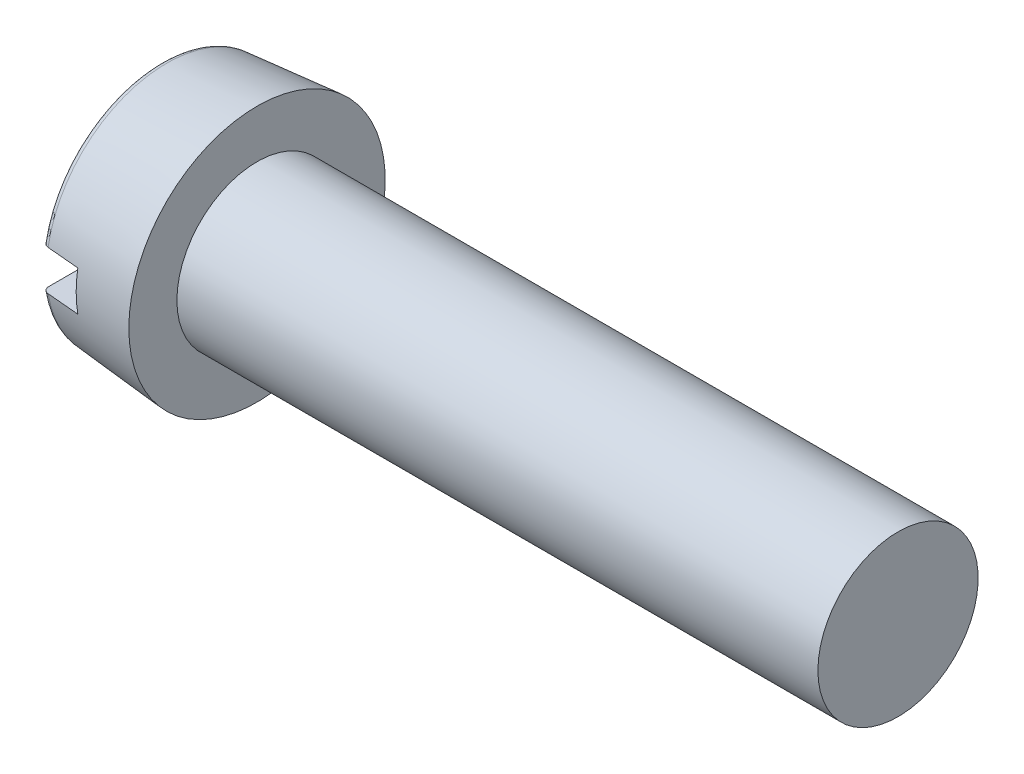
ISO-10303-21;
HEADER;
FILE_DESCRIPTION(('STEP AP214'),'2;1');
FILE_NAME('part.step','',(''),(''),'','','');
FILE_SCHEMA(('AUTOMOTIVE_DESIGN { 1 0 10303 214 1 1 1 1 }'));
ENDSEC;
DATA;
#1=APPLICATION_CONTEXT('core data for automotive mechanical design processes');
#2=APPLICATION_PROTOCOL_DEFINITION('international standard','automotive_design',2000,#1);
#3=PRODUCT_CONTEXT('',#1,'mechanical');
#4=PRODUCT('Part','Part','',(#3));
#5=PRODUCT_RELATED_PRODUCT_CATEGORY('part','',(#4));
#6=PRODUCT_DEFINITION_FORMATION('','',#4);
#7=PRODUCT_DEFINITION_CONTEXT('part definition',#1,'design');
#8=PRODUCT_DEFINITION('design','',#6,#7);
#9=PRODUCT_DEFINITION_SHAPE('','',#8);
#10=(LENGTH_UNIT() NAMED_UNIT(*) SI_UNIT(.MILLI.,.METRE.));
#11=(NAMED_UNIT(*) PLANE_ANGLE_UNIT() SI_UNIT($,.RADIAN.));
#12=(NAMED_UNIT(*) SI_UNIT($,.STERADIAN.) SOLID_ANGLE_UNIT());
#13=UNCERTAINTY_MEASURE_WITH_UNIT(LENGTH_MEASURE(1.E-05),#10,'distance_accuracy_value','');
#14=(GEOMETRIC_REPRESENTATION_CONTEXT(3) GLOBAL_UNCERTAINTY_ASSIGNED_CONTEXT((#13)) GLOBAL_UNIT_ASSIGNED_CONTEXT((#10,
#11,#12)) REPRESENTATION_CONTEXT('',''));
#15=CARTESIAN_POINT('',(0.,0.,0.));
#16=DIRECTION('',(0.,0.,1.));
#17=DIRECTION('',(1.,0.,0.));
#18=AXIS2_PLACEMENT_3D('',#15,#16,#17);
#19=CARTESIAN_POINT('',(0.,0.,0.));
#20=DIRECTION('',(1.,0.,0.));
#21=DIRECTION('',(0.,0.,-1.));
#22=AXIS2_PLACEMENT_3D('',#19,#20,#21);
#23=PLANE('',#22);
#24=CARTESIAN_POINT('',(0.,0.,0.));
#25=DIRECTION('',(1.,0.,0.));
#26=DIRECTION('',(0.,0.,-1.));
#27=AXIS2_PLACEMENT_3D('',#24,#25,#26);
#28=CIRCLE('',#27,7.10853554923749);
#29=CARTESIAN_POINT('',(0.,1.25,6.99776947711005));
#30=VERTEX_POINT('',#29);
#31=CARTESIAN_POINT('',(0.,1.25,-6.99776947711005));
#32=VERTEX_POINT('',#31);
#33=EDGE_CURVE('E109',#30,#32,#28,.F.);
#34=ORIENTED_EDGE('',*,*,#33,.T.);
#35=DIRECTION('',(0.,0.,-1.));
#36=VECTOR('',#35,1.);
#37=CARTESIAN_POINT('',(0.,1.25,-8.));
#38=LINE('',#37,#36);
#39=EDGE_CURVE('E106',#30,#32,#38,.T.);
#40=ORIENTED_EDGE('',*,*,#39,.F.);
#41=EDGE_LOOP('',(#34,#40));
#42=FACE_BOUND('',#41,.T.);
#43=ADVANCED_FACE('F39',(#42),#23,.F.);
#44=CARTESIAN_POINT('',(0.4,0.,0.));
#45=DIRECTION('',(1.,0.,0.));
#46=DIRECTION('',(0.,0.,-1.));
#47=AXIS2_PLACEMENT_3D('',#44,#45,#46);
#48=TOROIDAL_SURFACE('',#47,7.10853554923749,0.4);
#49=CARTESIAN_POINT('',(0.132475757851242,1.25,-7.29965638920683));
#50=CARTESIAN_POINT('',(0.148990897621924,1.25,-7.31472881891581));
#51=CARTESIAN_POINT('',(0.166777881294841,1.25,-7.32842972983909));
#52=CARTESIAN_POINT('',(0.204409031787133,1.25,-7.35266985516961));
#53=CARTESIAN_POINT('',(0.224255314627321,1.25,-7.36320577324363));
#54=CARTESIAN_POINT('',(0.265441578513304,1.25,-7.38078477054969));
#55=CARTESIAN_POINT('',(0.286781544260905,1.25,-7.38782788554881));
#56=CARTESIAN_POINT('',(0.330340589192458,1.25,-7.39820117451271));
#57=CARTESIAN_POINT('',(0.352559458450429,1.25,-7.40153222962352));
#58=CARTESIAN_POINT('',(0.39708917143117,1.25,-7.40437165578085));
#59=CARTESIAN_POINT('',(0.419398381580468,1.25,-7.40390568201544));
#60=CARTESIAN_POINT('',(0.463620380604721,1.25,-7.39922637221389));
#61=CARTESIAN_POINT('',(0.485533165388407,1.25,-7.39501299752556));
#62=CARTESIAN_POINT('',(0.528297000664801,1.25,-7.38298011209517));
#63=CARTESIAN_POINT('',(0.549150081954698,1.25,-7.37516781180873));
#64=CARTESIAN_POINT('',(0.589260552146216,1.25,-7.35617509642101));
#65=CARTESIAN_POINT('',(0.608517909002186,1.25,-7.34499461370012));
#66=CARTESIAN_POINT('',(0.645030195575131,1.25,-7.31951314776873));
#67=CARTESIAN_POINT('',(0.662271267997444,1.25,-7.30519231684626));
#68=CARTESIAN_POINT('',(0.694141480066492,1.25,-7.27389212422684));
#69=CARTESIAN_POINT('',(0.70877046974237,1.25,-7.25691260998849));
#70=CARTESIAN_POINT('',(0.735200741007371,1.25,-7.22055032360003));
#71=CARTESIAN_POINT('',(0.746964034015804,1.25,-7.20113994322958));
#72=CARTESIAN_POINT('',(0.767117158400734,1.25,-7.16064078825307));
#73=CARTESIAN_POINT('',(0.775506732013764,1.25,-7.13955188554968));
#74=CARTESIAN_POINT('',(0.788794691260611,1.25,-7.09597716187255));
#75=CARTESIAN_POINT('',(0.793642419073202,1.25,-7.07347588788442));
#76=CARTESIAN_POINT('',(0.79953214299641,1.25,-7.02798039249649));
#77=CARTESIAN_POINT('',(0.800573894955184,1.25,-7.00498613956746));
#78=CARTESIAN_POINT('',(0.79881979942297,1.25,-6.95891765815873));
#79=CARTESIAN_POINT('',(0.795986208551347,1.25,-6.93584485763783));
#80=CARTESIAN_POINT('',(0.78649006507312,1.25,-6.89050028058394));
#81=CARTESIAN_POINT('',(0.779827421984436,1.25,-6.86822852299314));
#82=CARTESIAN_POINT('',(0.762840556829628,1.25,-6.82510415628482));
#83=CARTESIAN_POINT('',(0.75251312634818,1.25,-6.80425280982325));
#84=CARTESIAN_POINT('',(0.728472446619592,1.25,-6.76460179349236));
#85=CARTESIAN_POINT('',(0.714759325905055,1.25,-6.74580204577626));
#86=CARTESIAN_POINT('',(0.684465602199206,1.25,-6.71098630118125));
#87=CARTESIAN_POINT('',(0.667913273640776,1.25,-6.6949457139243));
#88=CARTESIAN_POINT('',(0.632312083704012,1.25,-6.66592631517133));
#89=CARTESIAN_POINT('',(0.613263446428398,1.25,-6.6529472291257));
#90=CARTESIAN_POINT('',(0.573538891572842,1.25,-6.63064399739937));
#91=CARTESIAN_POINT('',(0.552894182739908,1.25,-6.62126426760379));
#92=CARTESIAN_POINT('',(0.510307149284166,1.25,-6.60616480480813));
#93=CARTESIAN_POINT('',(0.488364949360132,1.25,-6.60044472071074));
#94=CARTESIAN_POINT('',(0.444162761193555,1.25,-6.59290706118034));
#95=CARTESIAN_POINT('',(0.421912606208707,1.25,-6.59103174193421));
#96=CARTESIAN_POINT('',(0.377416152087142,1.25,-6.59106992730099));
#97=CARTESIAN_POINT('',(0.355169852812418,1.25,-6.59298324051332));
#98=CARTESIAN_POINT('',(0.311460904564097,1.25,-6.60051294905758));
#99=CARTESIAN_POINT('',(0.289994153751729,1.25,-6.60610558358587));
#100=CARTESIAN_POINT('',(0.248296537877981,1.25,-6.62079614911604));
#101=CARTESIAN_POINT('',(0.228065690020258,1.25,-6.62989412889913));
#102=CARTESIAN_POINT('',(0.189287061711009,1.25,-6.65137810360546));
#103=CARTESIAN_POINT('',(0.170749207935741,1.25,-6.66378200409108));
#104=CARTESIAN_POINT('',(0.135980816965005,1.25,-6.69148453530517));
#105=CARTESIAN_POINT('',(0.119750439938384,1.25,-6.7067833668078));
#106=CARTESIAN_POINT('',(0.0898040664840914,1.25,-6.74007476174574));
#107=CARTESIAN_POINT('',(0.0761278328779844,1.25,-6.75810308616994));
#108=CARTESIAN_POINT('',(0.0519386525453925,1.25,-6.79616955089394));
#109=CARTESIAN_POINT('',(0.0414259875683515,1.25,-6.81620786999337));
#110=CARTESIAN_POINT('',(0.0236867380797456,1.25,-6.85807628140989));
#111=CARTESIAN_POINT('',(0.0165164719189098,1.25,-6.87993024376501));
#112=CARTESIAN_POINT('',(0.00590326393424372,1.25,-6.92452467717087));
#113=CARTESIAN_POINT('',(0.00246043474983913,1.25,-6.94726517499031));
#114=CARTESIAN_POINT('',(-0.000624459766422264,1.25,-6.9932443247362));
#115=CARTESIAN_POINT('',(-0.000226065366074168,1.25,-7.01648570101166));
#116=CARTESIAN_POINT('',(0.00446361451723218,1.25,-7.06257934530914));
#117=CARTESIAN_POINT('',(0.00875592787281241,1.25,-7.08543150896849));
#118=CARTESIAN_POINT('',(0.0211326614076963,1.25,-7.13011343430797));
#119=CARTESIAN_POINT('',(0.0292216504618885,1.25,-7.15194192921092));
#120=CARTESIAN_POINT('',(0.0489774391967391,1.25,-7.1938938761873));
#121=CARTESIAN_POINT('',(0.060639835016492,1.25,-7.21401938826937));
#122=CARTESIAN_POINT('',(0.0824216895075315,1.25,-7.24513458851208));
#123=CARTESIAN_POINT('',(0.0915853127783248,1.25,-7.25680502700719));
#124=CARTESIAN_POINT('',(0.111138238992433,1.25,-7.27907001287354));
#125=CARTESIAN_POINT('',(0.121527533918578,1.25,-7.28966456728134));
#126=CARTESIAN_POINT('',(0.132475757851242,1.25,-7.29965638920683));
#127=B_SPLINE_CURVE_WITH_KNOTS('',3,(#49,#50,#51,#52,#53,#54,#55,#56,#57,#58,#59,#60,#61,#62,
#63,#64,#65,#66,#67,#68,#69,#70,#71,#72,#73,#74,#75,#76,#77,#78,#79,#80,#81,#82,#83,#84,#85,#86,
#87,#88,#89,#90,#91,#92,#93,#94,#95,#96,#97,#98,#99,#100,#101,#102,#103,#104,#105,#106,#107,
#108,#109,#110,#111,#112,#113,#114,#115,#116,#117,#118,#119,#120,#121,#122,#123,#124,#125,#126),
.UNSPECIFIED.,.T.,.F.,(4,2,2,2,2,2,2,2,2,2,2,2,2,2,2,2,2,2,2,2,2,2,2,2,2,2,2,2,2,2,2,2,2,2,2,2,
2,2,4),(0.,0.0670239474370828,0.134117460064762,0.20121028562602,0.268287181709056,
0.334911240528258,0.401535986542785,0.468027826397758,0.534521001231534,0.601447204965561,
0.668377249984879,0.736151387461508,0.80393070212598,0.872661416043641,0.94139653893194,
1.01080588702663,1.08021687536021,1.1496887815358,1.21915805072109,1.28797189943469,
1.35677957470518,1.4244772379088,1.49216840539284,1.55883525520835,1.62549873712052,
1.69173588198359,1.75797394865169,1.82457833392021,1.891187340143,1.95875976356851,
2.02633820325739,2.09501746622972,2.1636988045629,2.23310434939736,2.30252822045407,
2.37203585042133,2.44145816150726,2.48588999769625,2.53032154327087),.UNSPECIFIED.);
#128=CARTESIAN_POINT('',(0.365137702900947,1.25,-7.40221254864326));
#129=VERTEX_POINT('',#128);
#130=EDGE_CURVE('E63',#32,#129,#127,.T.);
#131=ORIENTED_EDGE('',*,*,#130,.F.);
#132=ORIENTED_EDGE('',*,*,#33,.F.);
#133=CARTESIAN_POINT('',(0.15668547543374,1.25,6.67501605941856));
#134=CARTESIAN_POINT('',(0.174256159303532,1.25,6.66131739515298));
#135=CARTESIAN_POINT('',(0.192982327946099,1.25,6.64907708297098));
#136=CARTESIAN_POINT('',(0.232233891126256,1.25,6.62789477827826));
#137=CARTESIAN_POINT('',(0.252761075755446,1.25,6.61895611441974));
#138=CARTESIAN_POINT('',(0.295032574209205,1.25,6.60466535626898));
#139=CARTESIAN_POINT('',(0.316776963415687,1.25,6.59931348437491));
#140=CARTESIAN_POINT('',(0.360853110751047,1.25,6.592369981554));
#141=CARTESIAN_POINT('',(0.383184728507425,1.25,6.59077746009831));
#142=CARTESIAN_POINT('',(0.42762602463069,1.25,6.591398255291));
#143=CARTESIAN_POINT('',(0.44973610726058,1.25,6.59358298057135));
#144=CARTESIAN_POINT('',(0.493275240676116,1.25,6.60163431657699));
#145=CARTESIAN_POINT('',(0.514704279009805,1.25,6.60750099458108));
#146=CARTESIAN_POINT('',(0.556279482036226,1.25,6.6227333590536));
#147=CARTESIAN_POINT('',(0.576425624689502,1.25,6.63209910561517));
#148=CARTESIAN_POINT('',(0.614883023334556,1.25,6.65404433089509));
#149=CARTESIAN_POINT('',(0.633194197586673,1.25,6.66662395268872));
#150=CARTESIAN_POINT('',(0.667684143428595,1.25,6.69478087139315));
#151=CARTESIAN_POINT('',(0.683837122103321,1.25,6.71038975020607));
#152=CARTESIAN_POINT('',(0.713345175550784,1.25,6.7440588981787));
#153=CARTESIAN_POINT('',(0.726700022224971,1.25,6.76211936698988));
#154=CARTESIAN_POINT('',(0.750464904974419,1.25,6.80049672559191));
#155=CARTESIAN_POINT('',(0.760822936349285,1.25,6.82084582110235));
#156=CARTESIAN_POINT('',(0.778030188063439,1.25,6.86297712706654));
#157=CARTESIAN_POINT('',(0.784879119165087,1.25,6.88475945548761));
#158=CARTESIAN_POINT('',(0.79496410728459,1.25,6.92946740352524));
#159=CARTESIAN_POINT('',(0.798148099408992,1.25,6.95240477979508));
#160=CARTESIAN_POINT('',(0.800643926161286,1.25,6.99848978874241));
#161=CARTESIAN_POINT('',(0.799955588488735,1.25,7.02163743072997));
#162=CARTESIAN_POINT('',(0.794705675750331,1.25,7.06762095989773));
#163=CARTESIAN_POINT('',(0.790122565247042,1.25,7.0904543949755));
#164=CARTESIAN_POINT('',(0.777170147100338,1.25,7.13502176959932));
#165=CARTESIAN_POINT('',(0.768800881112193,1.25,7.15675572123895));
#166=CARTESIAN_POINT('',(0.748544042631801,1.25,7.19839107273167));
#167=CARTESIAN_POINT('',(0.736673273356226,1.25,7.2183006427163));
#168=CARTESIAN_POINT('',(0.709718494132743,1.25,7.25581170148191));
#169=CARTESIAN_POINT('',(0.694634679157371,1.25,7.27341333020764));
#170=CARTESIAN_POINT('',(0.661876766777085,1.25,7.30557422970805));
#171=CARTESIAN_POINT('',(0.644236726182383,1.25,7.32016818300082));
#172=CARTESIAN_POINT('',(0.606727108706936,1.25,7.34613622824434));
#173=CARTESIAN_POINT('',(0.586857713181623,1.25,7.35751058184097));
#174=CARTESIAN_POINT('',(0.545758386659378,1.25,7.37654767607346));
#175=CARTESIAN_POINT('',(0.52455188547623,1.25,7.38426101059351));
#176=CARTESIAN_POINT('',(0.481137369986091,1.25,7.39597548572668));
#177=CARTESIAN_POINT('',(0.458929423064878,1.25,7.39997687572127));
#178=CARTESIAN_POINT('',(0.414390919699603,1.25,7.40412092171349));
#179=CARTESIAN_POINT('',(0.392064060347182,1.25,7.40430340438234));
#180=CARTESIAN_POINT('',(0.347698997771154,1.25,7.40090585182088));
#181=CARTESIAN_POINT('',(0.325660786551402,1.25,7.39732592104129));
#182=CARTESIAN_POINT('',(0.282559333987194,1.25,7.38652855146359));
#183=CARTESIAN_POINT('',(0.261493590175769,1.25,7.37932109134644));
#184=CARTESIAN_POINT('',(0.220861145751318,1.25,7.36149175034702));
#185=CARTESIAN_POINT('',(0.201294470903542,1.25,7.35086981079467));
#186=CARTESIAN_POINT('',(0.164087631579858,1.25,7.32645533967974));
#187=CARTESIAN_POINT('',(0.146459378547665,1.25,7.31264466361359));
#188=CARTESIAN_POINT('',(0.113736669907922,1.25,7.28229253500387));
#189=CARTESIAN_POINT('',(0.0986423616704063,1.25,7.26575092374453));
#190=CARTESIAN_POINT('',(0.0712157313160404,1.25,7.23019262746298));
#191=CARTESIAN_POINT('',(0.0589194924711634,1.25,7.2111481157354));
#192=CARTESIAN_POINT('',(0.0376470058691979,1.25,7.17128762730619));
#193=CARTESIAN_POINT('',(0.0286710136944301,1.25,7.15047151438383));
#194=CARTESIAN_POINT('',(0.0141628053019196,1.25,7.10734319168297));
#195=CARTESIAN_POINT('',(0.00868112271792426,1.25,7.08501397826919));
#196=CARTESIAN_POINT('',(0.00150168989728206,1.25,7.03975592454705));
#197=CARTESIAN_POINT('',(-0.000195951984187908,1.25,7.01682706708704));
#198=CARTESIAN_POINT('',(0.000234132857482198,1.25,6.97076875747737));
#199=CARTESIAN_POINT('',(0.00240136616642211,1.25,6.94763966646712));
#200=CARTESIAN_POINT('',(0.0105811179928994,1.25,6.9020645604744));
#201=CARTESIAN_POINT('',(0.0165946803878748,1.25,6.87961873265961));
#202=CARTESIAN_POINT('',(0.0323258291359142,1.25,6.83600920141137));
#203=CARTESIAN_POINT('',(0.0420516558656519,1.25,6.81484847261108));
#204=CARTESIAN_POINT('',(0.0649421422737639,1.25,6.77449865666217));
#205=CARTESIAN_POINT('',(0.0781025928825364,1.25,6.75530719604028));
#206=CARTESIAN_POINT('',(0.102248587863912,1.25,6.72585361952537));
#207=CARTESIAN_POINT('',(0.112339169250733,1.25,6.7148457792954));
#208=CARTESIAN_POINT('',(0.133675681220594,1.25,6.69401274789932));
#209=CARTESIAN_POINT('',(0.144921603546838,1.25,6.68418754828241));
#210=CARTESIAN_POINT('',(0.15668547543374,1.25,6.67501605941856));
#211=B_SPLINE_CURVE_WITH_KNOTS('',3,(#133,#134,#135,#136,#137,#138,#139,#140,#141,#142,#143,
#144,#145,#146,#147,#148,#149,#150,#151,#152,#153,#154,#155,#156,#157,#158,#159,#160,#161,#162,
#163,#164,#165,#166,#167,#168,#169,#170,#171,#172,#173,#174,#175,#176,#177,#178,#179,#180,#181,
#182,#183,#184,#185,#186,#187,#188,#189,#190,#191,#192,#193,#194,#195,#196,#197,#198,#199,#200,
#201,#202,#203,#204,#205,#206,#207,#208,#209,#210),.UNSPECIFIED.,.T.,.F.,(4,2,2,2,2,2,2,2,2,2,2,
2,2,2,2,2,2,2,2,2,2,2,2,2,2,2,2,2,2,2,2,2,2,2,2,2,2,2,4),(0.,0.0667854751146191,
0.133638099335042,0.200494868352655,0.267335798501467,0.333672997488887,0.400011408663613,
0.46635095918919,0.532693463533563,0.599768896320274,0.66684979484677,0.735033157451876,
0.803222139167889,0.872368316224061,0.941517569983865,1.01105167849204,1.08058502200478,
1.14978996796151,1.2189907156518,1.28734229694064,1.35568832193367,1.42306015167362,
1.49042745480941,1.55709184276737,1.62375438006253,1.69023453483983,1.75671583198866,
1.82358517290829,1.89045840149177,1.9581504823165,2.02584777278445,2.09450310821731,
2.1631604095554,2.23252355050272,2.30190552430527,2.37144241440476,2.4408944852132,
2.48560881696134,2.53032282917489),.UNSPECIFIED.);
#212=CARTESIAN_POINT('',(0.365137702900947,1.25,7.40221254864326));
#213=VERTEX_POINT('',#212);
#214=EDGE_CURVE('E99',#213,#30,#211,.T.);
#215=ORIENTED_EDGE('',*,*,#214,.F.);
#216=CARTESIAN_POINT('',(0.365137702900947,0.,0.));
#217=DIRECTION('',(-1.,0.,0.));
#218=DIRECTION('',(0.,0.,1.));
#219=AXIS2_PLACEMENT_3D('',#216,#217,#218);
#220=CIRCLE('',#219,7.50701342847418);
#221=EDGE_CURVE('E108',#129,#213,#220,.F.);
#222=ORIENTED_EDGE('',*,*,#221,.F.);
#223=EDGE_LOOP('',(#131,#132,#215,#222));
#224=FACE_BOUND('',#223,.T.);
#225=ADVANCED_FACE('F194',(#224),#48,.T.);
#226=CARTESIAN_POINT('',(0.,-1.25,-6.99776947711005));
#227=VERTEX_POINT('',#226);
#228=CARTESIAN_POINT('',(0.,-1.25,6.99776947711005));
#229=VERTEX_POINT('',#228);
#230=EDGE_CURVE('E105',#227,#229,#28,.F.);
#231=ORIENTED_EDGE('',*,*,#230,.T.);
#232=DIRECTION('',(0.,0.,1.));
#233=VECTOR('',#232,1.);
#234=CARTESIAN_POINT('',(0.,-1.25,-8.));
#235=LINE('',#234,#233);
#236=EDGE_CURVE('E55',#227,#229,#235,.T.);
#237=ORIENTED_EDGE('',*,*,#236,.F.);
#238=EDGE_LOOP('',(#231,#237));
#239=FACE_BOUND('',#238,.T.);
#240=ADVANCED_FACE('F104',(#239),#23,.F.);
#241=CARTESIAN_POINT('',(6.,0.,0.));
#242=DIRECTION('',(1.,0.,0.));
#243=DIRECTION('',(0.,0.,-1.));
#244=AXIS2_PLACEMENT_3D('',#241,#242,#243);
#245=CONICAL_SURFACE('',#244,8.,0.0872664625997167);
#246=CARTESIAN_POINT('',(2.4,0.,0.));
#247=DIRECTION('',(-1.,0.,0.));
#248=DIRECTION('',(0.,0.,1.));
#249=AXIS2_PLACEMENT_3D('',#246,#247,#248);
#250=CIRCLE('',#249,7.68504081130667);
#251=CARTESIAN_POINT('',(2.4,1.25,-7.58270085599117));
#252=VERTEX_POINT('',#251);
#253=CARTESIAN_POINT('',(2.4,-1.25,-7.58270085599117));
#254=VERTEX_POINT('',#253);
#255=EDGE_CURVE('E11',#252,#254,#250,.T.);
#256=ORIENTED_EDGE('',*,*,#255,.F.);
#257=CARTESIAN_POINT('',(15.1487514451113,1.25,-8.71118545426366));
#258=CARTESIAN_POINT('',(12.8323092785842,1.25,-8.50644348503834));
#259=CARTESIAN_POINT('',(10.5158792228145,1.25,-8.3015643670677));
#260=CARTESIAN_POINT('',(5.88305125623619,1.25,-7.89144412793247));
#261=CARTESIAN_POINT('',(3.56665334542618,1.25,-7.68620300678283));
#262=CARTESIAN_POINT('',(-1.06610264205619,1.25,-7.2752710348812));
#263=CARTESIAN_POINT('',(-3.38246071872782,1.25,-7.06958018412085));
#264=CARTESIAN_POINT('',(-8.01512399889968,1.25,-6.65760290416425));
#265=CARTESIAN_POINT('',(-10.3314292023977,1.25,-6.45131647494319));
#266=CARTESIAN_POINT('',(-12.6477013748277,1.25,-6.24465933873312));
#267=B_SPLINE_CURVE_WITH_KNOTS('',3,(#257,#258,#259,#260,#261,#262,#263,#264,#265,#266),
.UNSPECIFIED.,.F.,.F.,(4,2,2,2,4),(0.,6.97641830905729,13.9528363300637,20.9292544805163,
27.9056729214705),.UNSPECIFIED.);
#268=EDGE_CURVE('E171',#252,#129,#267,.T.);
#269=ORIENTED_EDGE('',*,*,#268,.T.);
#270=ORIENTED_EDGE('',*,*,#221,.T.);
#271=CARTESIAN_POINT('',(-12.6477013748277,1.25,6.24465933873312));
#272=CARTESIAN_POINT('',(-8.75782940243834,1.25,6.59168512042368));
#273=CARTESIAN_POINT('',(-4.86786867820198,1.25,6.93771339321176));
#274=CARTESIAN_POINT('',(-0.235140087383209,1.25,7.34895529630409));
#275=CARTESIAN_POINT('',(0.507566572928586,1.25,7.41485821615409));
#276=CARTESIAN_POINT('',(5.88303167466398,1.25,7.89166585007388));
#277=CARTESIAN_POINT('',(10.5158712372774,1.25,8.30165647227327));
#278=CARTESIAN_POINT('',(15.1487514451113,1.25,8.71118545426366));
#279=B_SPLINE_CURVE_WITH_KNOTS('',3,(#271,#272,#273,#274,#275,#276,#277,#278),.UNSPECIFIED.,.F.,
.F.,(4,2,2,4),(0.,11.7159620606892,13.952836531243,27.9056728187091),.UNSPECIFIED.);
#280=CARTESIAN_POINT('',(2.4,1.25,7.58270085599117));
#281=VERTEX_POINT('',#280);
#282=EDGE_CURVE('E165',#213,#281,#279,.T.);
#283=ORIENTED_EDGE('',*,*,#282,.T.);
#284=CARTESIAN_POINT('',(2.4,-1.25,7.58270085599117));
#285=VERTEX_POINT('',#284);
#286=EDGE_CURVE('E44',#285,#281,#250,.T.);
#287=ORIENTED_EDGE('',*,*,#286,.F.);
#288=CARTESIAN_POINT('',(15.1487514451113,-1.25,8.71118545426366));
#289=CARTESIAN_POINT('',(12.8323092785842,-1.25,8.50644348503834));
#290=CARTESIAN_POINT('',(10.5158792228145,-1.25,8.3015643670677));
#291=CARTESIAN_POINT('',(5.88305125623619,-1.25,7.89144412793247));
#292=CARTESIAN_POINT('',(3.56665334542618,-1.25,7.68620300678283));
#293=CARTESIAN_POINT('',(-1.06610264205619,-1.25,7.2752710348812));
#294=CARTESIAN_POINT('',(-3.38246071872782,-1.25,7.06958018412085));
#295=CARTESIAN_POINT('',(-8.01512399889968,-1.25,6.65760290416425));
#296=CARTESIAN_POINT('',(-10.3314292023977,-1.25,6.45131647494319));
#297=CARTESIAN_POINT('',(-12.6477013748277,-1.25,6.24465933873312));
#298=B_SPLINE_CURVE_WITH_KNOTS('',3,(#288,#289,#290,#291,#292,#293,#294,#295,#296,#297),
.UNSPECIFIED.,.F.,.F.,(4,2,2,2,4),(0.,6.97641830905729,13.9528363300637,20.9292544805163,
27.9056729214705),.UNSPECIFIED.);
#299=CARTESIAN_POINT('',(0.365137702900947,-1.25,7.40221254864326));
#300=VERTEX_POINT('',#299);
#301=EDGE_CURVE('E141',#285,#300,#298,.T.);
#302=ORIENTED_EDGE('',*,*,#301,.T.);
#303=CARTESIAN_POINT('',(0.365137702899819,-1.25,-7.40221254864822));
#304=VERTEX_POINT('',#303);
#305=EDGE_CURVE('E112',#300,#304,#220,.F.);
#306=ORIENTED_EDGE('',*,*,#305,.T.);
#307=CARTESIAN_POINT('',(-12.6477013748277,-1.25,-6.24465933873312));
#308=CARTESIAN_POINT('',(-8.75782940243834,-1.25,-6.59168512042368));
#309=CARTESIAN_POINT('',(-4.86786867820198,-1.25,-6.93771339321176));
#310=CARTESIAN_POINT('',(-0.235140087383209,-1.25,-7.34895529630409));
#311=CARTESIAN_POINT('',(0.507566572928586,-1.25,-7.41485821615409));
#312=CARTESIAN_POINT('',(5.88303167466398,-1.25,-7.89166585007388));
#313=CARTESIAN_POINT('',(10.5158712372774,-1.25,-8.30165647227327));
#314=CARTESIAN_POINT('',(15.1487514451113,-1.25,-8.71118545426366));
#315=B_SPLINE_CURVE_WITH_KNOTS('',3,(#307,#308,#309,#310,#311,#312,#313,#314),.UNSPECIFIED.,.F.,
.F.,(4,2,2,4),(0.,11.7159620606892,13.952836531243,27.9056728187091),.UNSPECIFIED.);
#316=EDGE_CURVE('E94',#304,#254,#315,.T.);
#317=ORIENTED_EDGE('',*,*,#316,.T.);
#318=EDGE_LOOP('',(#256,#269,#270,#283,#287,#302,#306,#317));
#319=FACE_BOUND('',#318,.T.);
#320=CARTESIAN_POINT('',(6.,0.,0.));
#321=DIRECTION('',(-1.,0.,0.));
#322=DIRECTION('',(0.,0.,1.));
#323=AXIS2_PLACEMENT_3D('',#320,#321,#322);
#324=CIRCLE('',#323,8.);
#325=CARTESIAN_POINT('',(6.,0.,8.));
#326=VERTEX_POINT('',#325);
#327=EDGE_CURVE('E115',#326,#326,#324,.T.);
#328=ORIENTED_EDGE('',*,*,#327,.T.);
#329=EDGE_LOOP('',(#328));
#330=FACE_BOUND('',#329,.T.);
#331=ADVANCED_FACE('F155',(#319,#330),#245,.T.);
#332=CARTESIAN_POINT('',(6.,8.,0.));
#333=DIRECTION('',(-1.,0.,0.));
#334=DIRECTION('',(0.,0.,1.));
#335=AXIS2_PLACEMENT_3D('',#332,#333,#334);
#336=PLANE('',#335);
#337=ORIENTED_EDGE('',*,*,#327,.F.);
#338=EDGE_LOOP('',(#337));
#339=FACE_BOUND('',#338,.T.);
#340=CARTESIAN_POINT('',(6.,0.,0.));
#341=DIRECTION('',(-1.,0.,0.));
#342=DIRECTION('',(0.,0.,1.));
#343=AXIS2_PLACEMENT_3D('',#340,#341,#342);
#344=CIRCLE('',#343,5.);
#345=CARTESIAN_POINT('',(6.,0.,5.));
#346=VERTEX_POINT('',#345);
#347=EDGE_CURVE('E179',#346,#346,#344,.T.);
#348=ORIENTED_EDGE('',*,*,#347,.T.);
#349=EDGE_LOOP('',(#348));
#350=FACE_BOUND('',#349,.T.);
#351=ADVANCED_FACE('F159',(#339,#350),#336,.F.);
#352=CARTESIAN_POINT('',(0.,0.,0.));
#353=DIRECTION('',(-1.,0.,0.));
#354=DIRECTION('',(0.,0.,1.));
#355=AXIS2_PLACEMENT_3D('',#352,#353,#354);
#356=CYLINDRICAL_SURFACE('',#355,5.);
#357=ORIENTED_EDGE('',*,*,#347,.F.);
#358=EDGE_LOOP('',(#357));
#359=FACE_BOUND('',#358,.T.);
#360=CARTESIAN_POINT('',(46.,0.,0.));
#361=DIRECTION('',(-1.,0.,0.));
#362=DIRECTION('',(0.,0.,1.));
#363=AXIS2_PLACEMENT_3D('',#360,#361,#362);
#364=CIRCLE('',#363,5.);
#365=CARTESIAN_POINT('',(46.,0.,5.));
#366=VERTEX_POINT('',#365);
#367=EDGE_CURVE('E177',#366,#366,#364,.T.);
#368=ORIENTED_EDGE('',*,*,#367,.T.);
#369=EDGE_LOOP('',(#368));
#370=FACE_BOUND('',#369,.T.);
#371=ADVANCED_FACE('F188',(#359,#370),#356,.T.);
#372=CARTESIAN_POINT('',(46.,5.,0.));
#373=DIRECTION('',(-1.,0.,0.));
#374=DIRECTION('',(0.,0.,1.));
#375=AXIS2_PLACEMENT_3D('',#372,#373,#374);
#376=PLANE('',#375);
#377=ORIENTED_EDGE('',*,*,#367,.F.);
#378=EDGE_LOOP('',(#377));
#379=FACE_BOUND('',#378,.T.);
#380=ADVANCED_FACE('F134',(#379),#376,.F.);
#381=CARTESIAN_POINT('',(0.132475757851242,-1.25,-7.29965638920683));
#382=CARTESIAN_POINT('',(0.115625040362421,-1.25,-7.28427494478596));
#383=CARTESIAN_POINT('',(0.100074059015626,-1.25,-7.26744265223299));
#384=CARTESIAN_POINT('',(0.072016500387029,-1.25,-7.2313837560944));
#385=CARTESIAN_POINT('',(0.0595141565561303,-1.25,-7.21215387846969));
#386=CARTESIAN_POINT('',(0.0379148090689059,-1.25,-7.17189363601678));
#387=CARTESIAN_POINT('',(0.028814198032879,-1.25,-7.15086520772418));
#388=CARTESIAN_POINT('',(0.014237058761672,-1.25,-7.10759561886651));
#389=CARTESIAN_POINT('',(0.00875961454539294,-1.25,-7.08535476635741));
#390=CARTESIAN_POINT('',(0.00152481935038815,-1.25,-7.04005432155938));
#391=CARTESIAN_POINT('',(-0.000195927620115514,-1.25,-7.01698887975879));
#392=CARTESIAN_POINT('',(0.000231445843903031,-1.25,-6.9708922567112));
#393=CARTESIAN_POINT('',(0.00237993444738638,-1.25,-6.94786107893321));
#394=CARTESIAN_POINT('',(0.0105153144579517,-1.25,-6.90232994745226));
#395=CARTESIAN_POINT('',(0.0165272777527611,-1.25,-6.87983446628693));
#396=CARTESIAN_POINT('',(0.0322550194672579,-1.25,-6.83617683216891));
#397=CARTESIAN_POINT('',(0.0419707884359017,-1.25,-6.81501467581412));
#398=CARTESIAN_POINT('',(0.0648081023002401,-1.25,-6.77471156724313));
#399=CARTESIAN_POINT('',(0.0779176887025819,-1.25,-6.75556384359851));
#400=CARTESIAN_POINT('',(0.107204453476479,-1.25,-6.71977775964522));
#401=CARTESIAN_POINT('',(0.123381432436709,-1.25,-6.70313923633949));
#402=CARTESIAN_POINT('',(0.158125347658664,-1.25,-6.6730806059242));
#403=CARTESIAN_POINT('',(0.176658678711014,-1.25,-6.65962166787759));
#404=CARTESIAN_POINT('',(0.215753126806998,-1.25,-6.63606890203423));
#405=CARTESIAN_POINT('',(0.236314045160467,-1.25,-6.62597474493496));
#406=CARTESIAN_POINT('',(0.278509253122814,-1.25,-6.60961442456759));
#407=CARTESIAN_POINT('',(0.300119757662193,-1.25,-6.60328690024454));
#408=CARTESIAN_POINT('',(0.344101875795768,-1.25,-6.59440049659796));
#409=CARTESIAN_POINT('',(0.3664734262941,-1.25,-6.59184130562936));
#410=CARTESIAN_POINT('',(0.411048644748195,-1.25,-6.59058150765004));
#411=CARTESIAN_POINT('',(0.433250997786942,-1.25,-6.59183387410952));
#412=CARTESIAN_POINT('',(0.477127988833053,-1.25,-6.59805510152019));
#413=CARTESIAN_POINT('',(0.498802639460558,-1.25,-6.60302387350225));
#414=CARTESIAN_POINT('',(0.540980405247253,-1.25,-6.61651171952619));
#415=CARTESIAN_POINT('',(0.561485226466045,-1.25,-6.62502546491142));
#416=CARTESIAN_POINT('',(0.600794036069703,-1.25,-6.64534193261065));
#417=CARTESIAN_POINT('',(0.619597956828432,-1.25,-6.65714478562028));
#418=CARTESIAN_POINT('',(0.655176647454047,-1.25,-6.68382050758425));
#419=CARTESIAN_POINT('',(0.671929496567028,-1.25,-6.6987226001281));
#420=CARTESIAN_POINT('',(0.702744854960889,-1.25,-6.73108753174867));
#421=CARTESIAN_POINT('',(0.716807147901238,-1.25,-6.74855057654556));
#422=CARTESIAN_POINT('',(0.742084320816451,-1.25,-6.78584352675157));
#423=CARTESIAN_POINT('',(0.753249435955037,-1.25,-6.8057071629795));
#424=CARTESIAN_POINT('',(0.772142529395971,-1.25,-6.84700674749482));
#425=CARTESIAN_POINT('',(0.779870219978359,-1.25,-6.86844282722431));
#426=CARTESIAN_POINT('',(0.79177945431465,-1.25,-6.91261830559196));
#427=CARTESIAN_POINT('',(0.795907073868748,-1.25,-6.93537225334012));
#428=CARTESIAN_POINT('',(0.800312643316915,-1.25,-6.9812503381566));
#429=CARTESIAN_POINT('',(0.800590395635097,-1.25,-7.00437449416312));
#430=CARTESIAN_POINT('',(0.797273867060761,-1.25,-7.05050308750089));
#431=CARTESIAN_POINT('',(0.793653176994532,-1.25,-7.07350563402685));
#432=CARTESIAN_POINT('',(0.782588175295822,-1.25,-7.11857275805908));
#433=CARTESIAN_POINT('',(0.775143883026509,-1.25,-7.1406373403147));
#434=CARTESIAN_POINT('',(0.756658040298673,-1.25,-7.18311323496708));
#435=CARTESIAN_POINT('',(0.745629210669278,-1.25,-7.2035300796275));
#436=CARTESIAN_POINT('',(0.720262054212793,-1.25,-7.24219335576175));
#437=CARTESIAN_POINT('',(0.705923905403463,-1.25,-7.26043990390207));
#438=CARTESIAN_POINT('',(0.674518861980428,-1.25,-7.29401378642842));
#439=CARTESIAN_POINT('',(0.657485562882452,-1.25,-7.30937253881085));
#440=CARTESIAN_POINT('',(0.621049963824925,-1.25,-7.33696221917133));
#441=CARTESIAN_POINT('',(0.601647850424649,-1.25,-7.34919339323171));
#442=CARTESIAN_POINT('',(0.561324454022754,-1.25,-7.3699966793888));
#443=CARTESIAN_POINT('',(0.540428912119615,-1.25,-7.37861869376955));
#444=CARTESIAN_POINT('',(0.49747763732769,-1.25,-7.39218682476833));
#445=CARTESIAN_POINT('',(0.475422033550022,-1.25,-7.39713334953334));
#446=CARTESIAN_POINT('',(0.431043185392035,-1.25,-7.4031624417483));
#447=CARTESIAN_POINT('',(0.408725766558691,-1.25,-7.40428796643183));
#448=CARTESIAN_POINT('',(0.364214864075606,-1.25,-7.40276022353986));
#449=CARTESIAN_POINT('',(0.34202140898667,-1.25,-7.40010611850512));
#450=CARTESIAN_POINT('',(0.298473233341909,-1.25,-7.39111627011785));
#451=CARTESIAN_POINT('',(0.277115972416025,-1.25,-7.38479278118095));
#452=CARTESIAN_POINT('',(0.235778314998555,-1.25,-7.36866899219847));
#453=CARTESIAN_POINT('',(0.215796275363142,-1.25,-7.35887293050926));
#454=CARTESIAN_POINT('',(0.185293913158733,-1.25,-7.34062461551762));
#455=CARTESIAN_POINT('',(0.174160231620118,-1.25,-7.33317637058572));
#456=CARTESIAN_POINT('',(0.152693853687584,-1.25,-7.31720397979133));
#457=CARTESIAN_POINT('',(0.142361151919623,-1.25,-7.30867984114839));
#458=CARTESIAN_POINT('',(0.132475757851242,-1.25,-7.29965638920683));
#459=B_SPLINE_CURVE_WITH_KNOTS('',3,(#381,#382,#383,#384,#385,#386,#387,#388,#389,#390,#391,
#392,#393,#394,#395,#396,#397,#398,#399,#400,#401,#402,#403,#404,#405,#406,#407,#408,#409,#410,
#411,#412,#413,#414,#415,#416,#417,#418,#419,#420,#421,#422,#423,#424,#425,#426,#427,#428,#429,
#430,#431,#432,#433,#434,#435,#436,#437,#438,#439,#440,#441,#442,#443,#444,#445,#446,#447,#448,
#449,#450,#451,#452,#453,#454,#455,#456,#457,#458),.UNSPECIFIED.,.T.,.F.,(4,2,2,2,2,2,2,2,2,2,2,
2,2,2,2,2,2,2,2,2,2,2,2,2,2,2,2,2,2,2,2,2,2,2,2,2,2,2,4),(0.,0.0683960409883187,
0.136886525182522,0.205304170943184,0.273704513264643,0.342768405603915,0.411838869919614,
0.481362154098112,0.55088526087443,0.62016665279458,0.689443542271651,0.757824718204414,
0.826199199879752,0.893426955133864,0.960649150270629,1.02704534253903,1.09343994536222,
1.1597351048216,1.22603289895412,1.29298674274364,1.35994596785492,1.42798884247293,
1.49603741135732,1.5650885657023,1.63414326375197,1.70366871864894,1.77319382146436,
1.84247483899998,1.91175213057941,1.98022551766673,2.04869351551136,2.11618078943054,
2.1836605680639,2.25037915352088,2.3171125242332,2.38362430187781,2.45005517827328,
2.49017966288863,2.53030387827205),.UNSPECIFIED.);
#460=EDGE_CURVE('E90',#304,#227,#459,.T.);
#461=ORIENTED_EDGE('',*,*,#460,.F.);
#462=ORIENTED_EDGE('',*,*,#305,.F.);
#463=CARTESIAN_POINT('',(0.15668547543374,-1.25,6.67501605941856));
#464=CARTESIAN_POINT('',(0.138697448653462,-1.25,6.68904266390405));
#465=CARTESIAN_POINT('',(0.121894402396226,-1.25,6.70461880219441));
#466=CARTESIAN_POINT('',(0.0911386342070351,-1.25,6.7383941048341));
#467=CARTESIAN_POINT('',(0.0771899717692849,-1.25,6.75659694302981));
#468=CARTESIAN_POINT('',(0.0525468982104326,-1.25,6.79505798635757));
#469=CARTESIAN_POINT('',(0.0418488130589,-1.25,6.81531383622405));
#470=CARTESIAN_POINT('',(0.0239673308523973,-1.25,6.85731331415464));
#471=CARTESIAN_POINT('',(0.0167830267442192,-1.25,6.87905655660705));
#472=CARTESIAN_POINT('',(0.00605038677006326,-1.25,6.92366828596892));
#473=CARTESIAN_POINT('',(0.00254158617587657,-1.25,6.94654629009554));
#474=CARTESIAN_POINT('',(-0.000611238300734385,-1.25,6.9925687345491));
#475=CARTESIAN_POINT('',(-0.000254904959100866,-1.25,7.01571319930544));
#476=CARTESIAN_POINT('',(0.00433168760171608,-1.25,7.06175648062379));
#477=CARTESIAN_POINT('',(0.00858518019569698,-1.25,7.0846529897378));
#478=CARTESIAN_POINT('',(0.0208920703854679,-1.25,7.1294017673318));
#479=CARTESIAN_POINT('',(0.0289454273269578,-1.25,7.15125404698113));
#480=CARTESIAN_POINT('',(0.0485986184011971,-1.25,7.19318711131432));
#481=CARTESIAN_POINT('',(0.0601830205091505,-1.25,7.2132751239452));
#482=CARTESIAN_POINT('',(0.0865988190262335,-1.25,7.25118974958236));
#483=CARTESIAN_POINT('',(0.101430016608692,-1.25,7.2690165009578));
#484=CARTESIAN_POINT('',(0.13373079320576,-1.25,7.3016689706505));
#485=CARTESIAN_POINT('',(0.151166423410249,-1.25,7.31652826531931));
#486=CARTESIAN_POINT('',(0.188315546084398,-1.25,7.34305785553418));
#487=CARTESIAN_POINT('',(0.208028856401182,-1.25,7.35472840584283));
#488=CARTESIAN_POINT('',(0.248870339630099,-1.25,7.37437491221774));
#489=CARTESIAN_POINT('',(0.269974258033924,-1.25,7.38240129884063));
#490=CARTESIAN_POINT('',(0.31323845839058,-1.25,7.3947537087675));
#491=CARTESIAN_POINT('',(0.33539866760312,-1.25,7.39907998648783));
#492=CARTESIAN_POINT('',(0.379892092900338,-1.25,7.40387138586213));
#493=CARTESIAN_POINT('',(0.40222092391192,-1.25,7.40437730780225));
#494=CARTESIAN_POINT('',(0.446644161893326,-1.25,7.40162021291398));
#495=CARTESIAN_POINT('',(0.468738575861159,-1.25,7.39835730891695));
#496=CARTESIAN_POINT('',(0.511996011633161,-1.25,7.3881790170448));
#497=CARTESIAN_POINT('',(0.533161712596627,-1.25,7.38127500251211));
#498=CARTESIAN_POINT('',(0.574042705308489,-1.25,7.3640303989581));
#499=CARTESIAN_POINT('',(0.593757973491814,-1.25,7.35368975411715));
#500=CARTESIAN_POINT('',(0.631300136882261,-1.25,7.32981351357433));
#501=CARTESIAN_POINT('',(0.64911605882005,-1.25,7.31626067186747));
#502=CARTESIAN_POINT('',(0.682253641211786,-1.25,7.28638902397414));
#503=CARTESIAN_POINT('',(0.697575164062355,-1.25,7.27007006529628));
#504=CARTESIAN_POINT('',(0.72548940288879,-1.25,7.23492204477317));
#505=CARTESIAN_POINT('',(0.738047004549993,-1.25,7.21606510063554));
#506=CARTESIAN_POINT('',(0.759869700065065,-1.25,7.17653402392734));
#507=CARTESIAN_POINT('',(0.769134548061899,-1.25,7.15585975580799));
#508=CARTESIAN_POINT('',(0.784244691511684,-1.25,7.11296720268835));
#509=CARTESIAN_POINT('',(0.79003968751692,-1.25,7.09073119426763));
#510=CARTESIAN_POINT('',(0.797858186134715,-1.25,7.04560551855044));
#511=CARTESIAN_POINT('',(0.79988143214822,-1.25,7.02271580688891));
#512=CARTESIAN_POINT('',(0.80010962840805,-1.25,6.97667253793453));
#513=CARTESIAN_POINT('',(0.798273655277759,-1.25,6.95351876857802));
#514=CARTESIAN_POINT('',(0.790750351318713,-1.25,6.90784486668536));
#515=CARTESIAN_POINT('',(0.785062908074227,-1.25,6.88532475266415));
#516=CARTESIAN_POINT('',(0.769969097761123,-1.25,6.84151070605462));
#517=CARTESIAN_POINT('',(0.760554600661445,-1.25,6.82021957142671));
#518=CARTESIAN_POINT('',(0.738256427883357,-1.25,6.77953758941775));
#519=CARTESIAN_POINT('',(0.725372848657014,-1.25,6.76014668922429));
#520=CARTESIAN_POINT('',(0.696604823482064,-1.25,6.72399477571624));
#521=CARTESIAN_POINT('',(0.680745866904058,-1.25,6.70721348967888));
#522=CARTESIAN_POINT('',(0.64639599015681,-1.25,6.67660331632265));
#523=CARTESIAN_POINT('',(0.627905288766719,-1.25,6.66277418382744));
#524=CARTESIAN_POINT('',(0.589124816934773,-1.25,6.638694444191));
#525=CARTESIAN_POINT('',(0.568867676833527,-1.25,6.62839129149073));
#526=CARTESIAN_POINT('',(0.526892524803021,-1.25,6.6113951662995));
#527=CARTESIAN_POINT('',(0.505174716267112,-1.25,6.60470169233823));
#528=CARTESIAN_POINT('',(0.461264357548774,-1.25,6.59521646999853));
#529=CARTESIAN_POINT('',(0.439084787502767,-1.25,6.59236456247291));
#530=CARTESIAN_POINT('',(0.394557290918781,-1.25,6.59045711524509));
#531=CARTESIAN_POINT('',(0.372209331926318,-1.25,6.59140232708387));
#532=CARTESIAN_POINT('',(0.328161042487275,-1.25,6.59703803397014));
#533=CARTESIAN_POINT('',(0.306457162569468,-1.25,6.60170098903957));
#534=CARTESIAN_POINT('',(0.264155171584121,-1.25,6.61458958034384));
#535=CARTESIAN_POINT('',(0.243555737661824,-1.25,6.62281084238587));
#536=CARTESIAN_POINT('',(0.21194068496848,-1.25,6.63859503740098));
#537=CARTESIAN_POINT('',(0.200387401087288,-1.25,6.64510594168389));
#538=CARTESIAN_POINT('',(0.177984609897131,-1.25,6.65924228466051));
#539=CARTESIAN_POINT('',(0.167135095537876,-1.25,6.66686771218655));
#540=CARTESIAN_POINT('',(0.15668547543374,-1.25,6.67501605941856));
#541=B_SPLINE_CURVE_WITH_KNOTS('',3,(#463,#464,#465,#466,#467,#468,#469,#470,#471,#472,#473,
#474,#475,#476,#477,#478,#479,#480,#481,#482,#483,#484,#485,#486,#487,#488,#489,#490,#491,#492,
#493,#494,#495,#496,#497,#498,#499,#500,#501,#502,#503,#504,#505,#506,#507,#508,#509,#510,#511,
#512,#513,#514,#515,#516,#517,#518,#519,#520,#521,#522,#523,#524,#525,#526,#527,#528,#529,#530,
#531,#532,#533,#534,#535,#536,#537,#538,#539,#540),.UNSPECIFIED.,.T.,.F.,(4,2,2,2,2,2,2,2,2,2,2,
2,2,2,2,2,2,2,2,2,2,2,2,2,2,2,2,2,2,2,2,2,2,2,2,2,2,2,4),(0.,0.0683818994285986,
0.136860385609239,0.20526118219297,0.273644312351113,0.342755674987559,0.411873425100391,
0.481405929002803,0.55093768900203,0.620169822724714,0.689397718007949,0.757791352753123,
0.826179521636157,0.893590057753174,0.960995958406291,1.02768095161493,1.09436394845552,
1.16083987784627,1.22731688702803,1.29415923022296,1.36100525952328,1.42865694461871,
1.49631367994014,1.56492881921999,1.63354862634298,1.70289975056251,1.77225289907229,
1.84175817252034,1.91126151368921,1.98019458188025,2.04912192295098,2.11697211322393,
2.18481287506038,2.25157839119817,2.31835712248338,2.38464572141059,2.45085306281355,
2.49057793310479,2.53030240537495),.UNSPECIFIED.);
#542=EDGE_CURVE('E100',#229,#300,#541,.T.);
#543=ORIENTED_EDGE('',*,*,#542,.F.);
#544=ORIENTED_EDGE('',*,*,#230,.F.);
#545=EDGE_LOOP('',(#461,#462,#543,#544));
#546=FACE_BOUND('',#545,.T.);
#547=ADVANCED_FACE('F41',(#546),#48,.T.);
#548=CARTESIAN_POINT('',(2.4,-1.25,-8.));
#549=DIRECTION('',(-1.,0.,0.));
#550=DIRECTION('',(0.,0.,1.));
#551=AXIS2_PLACEMENT_3D('',#548,#549,#550);
#552=PLANE('',#551);
#553=ORIENTED_EDGE('',*,*,#255,.T.);
#554=DIRECTION('',(0.,0.,1.));
#555=VECTOR('',#554,1.);
#556=CARTESIAN_POINT('',(2.4,-1.25,-8.));
#557=LINE('',#556,#555);
#558=EDGE_CURVE('E276',#254,#285,#557,.T.);
#559=ORIENTED_EDGE('',*,*,#558,.T.);
#560=ORIENTED_EDGE('',*,*,#286,.T.);
#561=DIRECTION('',(0.,0.,-1.));
#562=VECTOR('',#561,1.);
#563=CARTESIAN_POINT('',(2.4,1.25,-8.));
#564=LINE('',#563,#562);
#565=EDGE_CURVE('E149',#281,#252,#564,.T.);
#566=ORIENTED_EDGE('',*,*,#565,.T.);
#567=EDGE_LOOP('',(#553,#559,#560,#566));
#568=FACE_BOUND('',#567,.T.);
#569=ADVANCED_FACE('F218',(#568),#552,.T.);
#570=CARTESIAN_POINT('',(2.4,1.25,-8.));
#571=DIRECTION('',(0.,1.,0.));
#572=DIRECTION('',(0.,0.,1.));
#573=AXIS2_PLACEMENT_3D('',#570,#571,#572);
#574=PLANE('',#573);
#575=ORIENTED_EDGE('',*,*,#565,.F.);
#576=ORIENTED_EDGE('',*,*,#282,.F.);
#577=ORIENTED_EDGE('',*,*,#214,.T.);
#578=ORIENTED_EDGE('',*,*,#39,.T.);
#579=ORIENTED_EDGE('',*,*,#130,.T.);
#580=ORIENTED_EDGE('',*,*,#268,.F.);
#581=EDGE_LOOP('',(#575,#576,#577,#578,#579,#580));
#582=FACE_BOUND('',#581,.T.);
#583=ADVANCED_FACE('F131',(#582),#574,.F.);
#584=CARTESIAN_POINT('',(2.4,-1.25,-8.));
#585=DIRECTION('',(0.,-1.,0.));
#586=DIRECTION('',(0.,0.,-1.));
#587=AXIS2_PLACEMENT_3D('',#584,#585,#586);
#588=PLANE('',#587);
#589=ORIENTED_EDGE('',*,*,#460,.T.);
#590=ORIENTED_EDGE('',*,*,#236,.T.);
#591=ORIENTED_EDGE('',*,*,#542,.T.);
#592=ORIENTED_EDGE('',*,*,#301,.F.);
#593=ORIENTED_EDGE('',*,*,#558,.F.);
#594=ORIENTED_EDGE('',*,*,#316,.F.);
#595=EDGE_LOOP('',(#589,#590,#591,#592,#593,#594));
#596=FACE_BOUND('',#595,.T.);
#597=ADVANCED_FACE('F91',(#596),#588,.F.);
#598=CLOSED_SHELL('',(#43,#225,#240,#331,#351,#371,#380,#547,#569,#583,#597));
#599=MANIFOLD_SOLID_BREP('B2',#598);
#600=ADVANCED_BREP_SHAPE_REPRESENTATION('',(#18,#599),#14);
#601=SHAPE_DEFINITION_REPRESENTATION(#9,#600);
ENDSEC;
END-ISO-10303-21;
